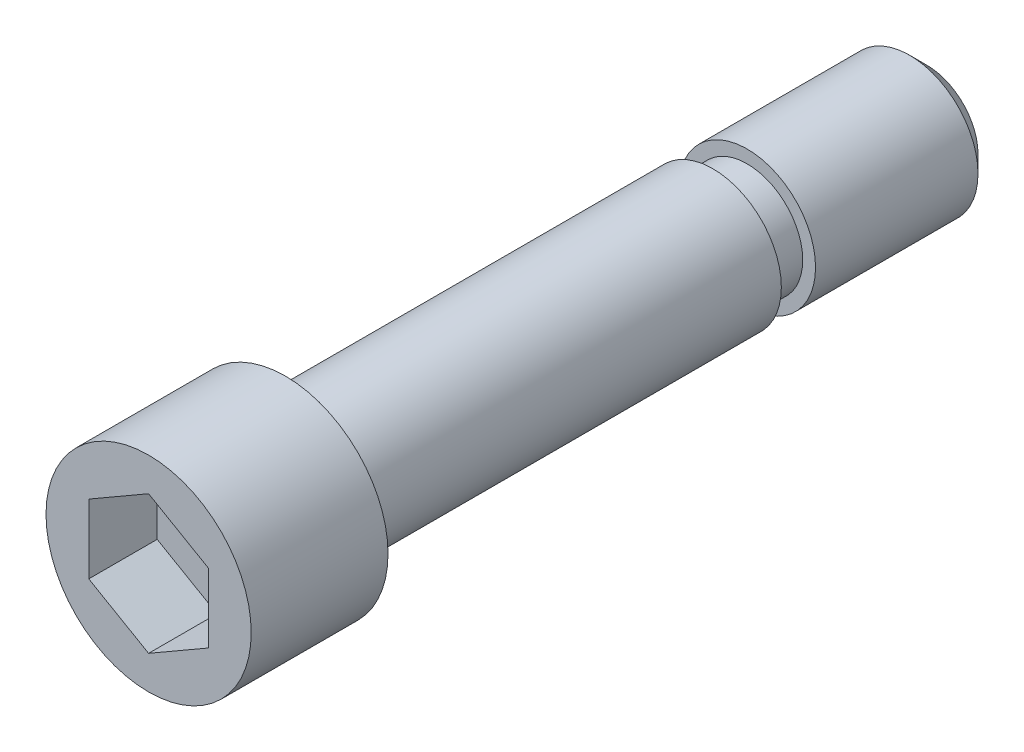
ISO-10303-21;
HEADER;
FILE_DESCRIPTION(('STEP AP214'),'2;1');
FILE_NAME('part.step','',(''),(''),'','','');
FILE_SCHEMA(('AUTOMOTIVE_DESIGN { 1 0 10303 214 1 1 1 1 }'));
ENDSEC;
DATA;
#1=APPLICATION_CONTEXT('core data for automotive mechanical design processes');
#2=APPLICATION_PROTOCOL_DEFINITION('international standard','automotive_design',2000,#1);
#3=PRODUCT_CONTEXT('',#1,'mechanical');
#4=PRODUCT('Part','Part','',(#3));
#5=PRODUCT_RELATED_PRODUCT_CATEGORY('part','',(#4));
#6=PRODUCT_DEFINITION_FORMATION('','',#4);
#7=PRODUCT_DEFINITION_CONTEXT('part definition',#1,'design');
#8=PRODUCT_DEFINITION('design','',#6,#7);
#9=PRODUCT_DEFINITION_SHAPE('','',#8);
#10=(LENGTH_UNIT() NAMED_UNIT(*) SI_UNIT(.MILLI.,.METRE.));
#11=(NAMED_UNIT(*) PLANE_ANGLE_UNIT() SI_UNIT($,.RADIAN.));
#12=(NAMED_UNIT(*) SI_UNIT($,.STERADIAN.) SOLID_ANGLE_UNIT());
#13=UNCERTAINTY_MEASURE_WITH_UNIT(LENGTH_MEASURE(1.E-05),#10,'distance_accuracy_value','');
#14=(GEOMETRIC_REPRESENTATION_CONTEXT(3) GLOBAL_UNCERTAINTY_ASSIGNED_CONTEXT((#13)) GLOBAL_UNIT_ASSIGNED_CONTEXT((#10,
#11,#12)) REPRESENTATION_CONTEXT('',''));
#15=CARTESIAN_POINT('',(0.,0.,0.));
#16=DIRECTION('',(0.,0.,1.));
#17=DIRECTION('',(1.,0.,0.));
#18=AXIS2_PLACEMENT_3D('',#15,#16,#17);
#19=CARTESIAN_POINT('',(-12.,0.,16.));
#20=DIRECTION('',(0.,0.,-1.));
#21=DIRECTION('',(-1.,0.,0.));
#22=AXIS2_PLACEMENT_3D('',#19,#20,#21);
#23=PLANE('',#22);
#24=DIRECTION('',(-0.866025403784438,-0.5,0.));
#25=VECTOR('',#24,1.);
#26=CARTESIAN_POINT('',(0.,8.08290376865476,16.));
#27=LINE('',#26,#25);
#28=CARTESIAN_POINT('',(0.,8.08290376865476,16.));
#29=VERTEX_POINT('',#28);
#30=CARTESIAN_POINT('',(-7.,4.04145188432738,16.));
#31=VERTEX_POINT('',#30);
#32=EDGE_CURVE('E82',#29,#31,#27,.T.);
#33=ORIENTED_EDGE('',*,*,#32,.F.);
#34=DIRECTION('',(-0.866025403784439,0.5,0.));
#35=VECTOR('',#34,1.);
#36=CARTESIAN_POINT('',(7.,4.04145188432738,16.));
#37=LINE('',#36,#35);
#38=CARTESIAN_POINT('',(7.,4.04145188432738,16.));
#39=VERTEX_POINT('',#38);
#40=EDGE_CURVE('E28',#39,#29,#37,.T.);
#41=ORIENTED_EDGE('',*,*,#40,.F.);
#42=DIRECTION('',(0.,1.,0.));
#43=VECTOR('',#42,1.);
#44=CARTESIAN_POINT('',(7.,-4.04145188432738,16.));
#45=LINE('',#44,#43);
#46=CARTESIAN_POINT('',(7.,-4.04145188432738,16.));
#47=VERTEX_POINT('',#46);
#48=EDGE_CURVE('E97',#47,#39,#45,.T.);
#49=ORIENTED_EDGE('',*,*,#48,.F.);
#50=DIRECTION('',(0.866025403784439,0.5,0.));
#51=VECTOR('',#50,1.);
#52=CARTESIAN_POINT('',(0.,-8.08290376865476,16.));
#53=LINE('',#52,#51);
#54=CARTESIAN_POINT('',(0.,-8.08290376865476,16.));
#55=VERTEX_POINT('',#54);
#56=EDGE_CURVE('E91',#55,#47,#53,.T.);
#57=ORIENTED_EDGE('',*,*,#56,.F.);
#58=DIRECTION('',(0.866025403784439,-0.5,0.));
#59=VECTOR('',#58,1.);
#60=CARTESIAN_POINT('',(-7.,-4.04145188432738,16.));
#61=LINE('',#60,#59);
#62=CARTESIAN_POINT('',(-7.,-4.04145188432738,16.));
#63=VERTEX_POINT('',#62);
#64=EDGE_CURVE('E89',#63,#55,#61,.T.);
#65=ORIENTED_EDGE('',*,*,#64,.F.);
#66=DIRECTION('',(0.,-1.,0.));
#67=VECTOR('',#66,1.);
#68=CARTESIAN_POINT('',(-7.,4.04145188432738,16.));
#69=LINE('',#68,#67);
#70=EDGE_CURVE('E71',#31,#63,#69,.T.);
#71=ORIENTED_EDGE('',*,*,#70,.F.);
#72=EDGE_LOOP('',(#33,#41,#49,#57,#65,#71));
#73=FACE_BOUND('',#72,.T.);
#74=CARTESIAN_POINT('',(0.,0.,16.));
#75=DIRECTION('',(0.,0.,1.));
#76=DIRECTION('',(1.,0.,0.));
#77=AXIS2_PLACEMENT_3D('',#74,#75,#76);
#78=CIRCLE('',#77,12.);
#79=CARTESIAN_POINT('',(12.,0.,16.));
#80=VERTEX_POINT('',#79);
#81=EDGE_CURVE('E9',#80,#80,#78,.T.);
#82=ORIENTED_EDGE('',*,*,#81,.T.);
#83=EDGE_LOOP('',(#82));
#84=FACE_BOUND('',#83,.T.);
#85=ADVANCED_FACE('F14',(#73,#84),#23,.F.);
#86=CARTESIAN_POINT('',(0.,0.,5.));
#87=DIRECTION('',(0.,0.,1.));
#88=DIRECTION('',(1.,0.,0.));
#89=AXIS2_PLACEMENT_3D('',#86,#87,#88);
#90=CYLINDRICAL_SURFACE('',#89,12.);
#91=ORIENTED_EDGE('',*,*,#81,.F.);
#92=EDGE_LOOP('',(#91));
#93=FACE_BOUND('',#92,.T.);
#94=CARTESIAN_POINT('',(0.,0.,0.));
#95=DIRECTION('',(0.,0.,1.));
#96=DIRECTION('',(1.,0.,0.));
#97=AXIS2_PLACEMENT_3D('',#94,#95,#96);
#98=CIRCLE('',#97,12.);
#99=CARTESIAN_POINT('',(12.,0.,0.));
#100=VERTEX_POINT('',#99);
#101=EDGE_CURVE('E21',#100,#100,#98,.T.);
#102=ORIENTED_EDGE('',*,*,#101,.T.);
#103=EDGE_LOOP('',(#102));
#104=FACE_BOUND('',#103,.T.);
#105=ADVANCED_FACE('F144',(#93,#104),#90,.T.);
#106=CARTESIAN_POINT('',(-8.,0.,0.));
#107=DIRECTION('',(0.,0.,1.));
#108=DIRECTION('',(1.,0.,0.));
#109=AXIS2_PLACEMENT_3D('',#106,#107,#108);
#110=PLANE('',#109);
#111=ORIENTED_EDGE('',*,*,#101,.F.);
#112=EDGE_LOOP('',(#111));
#113=FACE_BOUND('',#112,.T.);
#114=CARTESIAN_POINT('',(0.,0.,0.));
#115=DIRECTION('',(0.,0.,1.));
#116=DIRECTION('',(1.,0.,0.));
#117=AXIS2_PLACEMENT_3D('',#114,#115,#116);
#118=CIRCLE('',#117,8.);
#119=CARTESIAN_POINT('',(8.,0.,0.));
#120=VERTEX_POINT('',#119);
#121=EDGE_CURVE('E139',#120,#120,#118,.T.);
#122=ORIENTED_EDGE('',*,*,#121,.T.);
#123=EDGE_LOOP('',(#122));
#124=FACE_BOUND('',#123,.T.);
#125=ADVANCED_FACE('F146',(#113,#124),#110,.F.);
#126=CARTESIAN_POINT('',(0.,0.,5.));
#127=DIRECTION('',(0.,0.,1.));
#128=DIRECTION('',(1.,0.,0.));
#129=AXIS2_PLACEMENT_3D('',#126,#127,#128);
#130=CYLINDRICAL_SURFACE('',#129,8.);
#131=ORIENTED_EDGE('',*,*,#121,.F.);
#132=EDGE_LOOP('',(#131));
#133=FACE_BOUND('',#132,.T.);
#134=CARTESIAN_POINT('',(0.,0.,-50.));
#135=DIRECTION('',(0.,0.,1.));
#136=DIRECTION('',(1.,0.,0.));
#137=AXIS2_PLACEMENT_3D('',#134,#135,#136);
#138=CIRCLE('',#137,8.);
#139=CARTESIAN_POINT('',(8.,0.,-50.));
#140=VERTEX_POINT('',#139);
#141=EDGE_CURVE('E136',#140,#140,#138,.T.);
#142=ORIENTED_EDGE('',*,*,#141,.T.);
#143=EDGE_LOOP('',(#142));
#144=FACE_BOUND('',#143,.T.);
#145=ADVANCED_FACE('F149',(#133,#144),#130,.T.);
#146=CARTESIAN_POINT('',(-6.5,0.,-50.));
#147=DIRECTION('',(0.,0.,1.));
#148=DIRECTION('',(1.,0.,0.));
#149=AXIS2_PLACEMENT_3D('',#146,#147,#148);
#150=PLANE('',#149);
#151=ORIENTED_EDGE('',*,*,#141,.F.);
#152=EDGE_LOOP('',(#151));
#153=FACE_BOUND('',#152,.T.);
#154=CARTESIAN_POINT('',(0.,0.,-50.));
#155=DIRECTION('',(0.,0.,1.));
#156=DIRECTION('',(1.,0.,0.));
#157=AXIS2_PLACEMENT_3D('',#154,#155,#156);
#158=CIRCLE('',#157,6.5);
#159=CARTESIAN_POINT('',(6.5,0.,-50.));
#160=VERTEX_POINT('',#159);
#161=EDGE_CURVE('E133',#160,#160,#158,.T.);
#162=ORIENTED_EDGE('',*,*,#161,.T.);
#163=EDGE_LOOP('',(#162));
#164=FACE_BOUND('',#163,.T.);
#165=ADVANCED_FACE('F155',(#153,#164),#150,.F.);
#166=CARTESIAN_POINT('',(0.,0.,5.));
#167=DIRECTION('',(0.,0.,1.));
#168=DIRECTION('',(1.,0.,0.));
#169=AXIS2_PLACEMENT_3D('',#166,#167,#168);
#170=CYLINDRICAL_SURFACE('',#169,6.5);
#171=ORIENTED_EDGE('',*,*,#161,.F.);
#172=EDGE_LOOP('',(#171));
#173=FACE_BOUND('',#172,.T.);
#174=CARTESIAN_POINT('',(0.,0.,-54.));
#175=DIRECTION('',(0.,0.,1.));
#176=DIRECTION('',(1.,0.,0.));
#177=AXIS2_PLACEMENT_3D('',#174,#175,#176);
#178=CIRCLE('',#177,6.5);
#179=CARTESIAN_POINT('',(6.5,0.,-54.));
#180=VERTEX_POINT('',#179);
#181=EDGE_CURVE('E130',#180,#180,#178,.T.);
#182=ORIENTED_EDGE('',*,*,#181,.T.);
#183=EDGE_LOOP('',(#182));
#184=FACE_BOUND('',#183,.T.);
#185=ADVANCED_FACE('F161',(#173,#184),#170,.T.);
#186=CARTESIAN_POINT('',(-8.,0.,-54.));
#187=DIRECTION('',(0.,0.,-1.));
#188=DIRECTION('',(-1.,0.,0.));
#189=AXIS2_PLACEMENT_3D('',#186,#187,#188);
#190=PLANE('',#189);
#191=ORIENTED_EDGE('',*,*,#181,.F.);
#192=EDGE_LOOP('',(#191));
#193=FACE_BOUND('',#192,.T.);
#194=CARTESIAN_POINT('',(0.,0.,-54.));
#195=DIRECTION('',(0.,0.,1.));
#196=DIRECTION('',(1.,0.,0.));
#197=AXIS2_PLACEMENT_3D('',#194,#195,#196);
#198=CIRCLE('',#197,8.);
#199=CARTESIAN_POINT('',(8.,0.,-54.));
#200=VERTEX_POINT('',#199);
#201=EDGE_CURVE('E127',#200,#200,#198,.T.);
#202=ORIENTED_EDGE('',*,*,#201,.T.);
#203=EDGE_LOOP('',(#202));
#204=FACE_BOUND('',#203,.T.);
#205=ADVANCED_FACE('F167',(#193,#204),#190,.F.);
#206=CARTESIAN_POINT('',(0.,0.,5.));
#207=DIRECTION('',(0.,0.,1.));
#208=DIRECTION('',(1.,0.,0.));
#209=AXIS2_PLACEMENT_3D('',#206,#207,#208);
#210=CYLINDRICAL_SURFACE('',#209,8.);
#211=ORIENTED_EDGE('',*,*,#201,.F.);
#212=EDGE_LOOP('',(#211));
#213=FACE_BOUND('',#212,.T.);
#214=CARTESIAN_POINT('',(0.,0.,-73.));
#215=DIRECTION('',(0.,0.,1.));
#216=DIRECTION('',(1.,0.,0.));
#217=AXIS2_PLACEMENT_3D('',#214,#215,#216);
#218=CIRCLE('',#217,8.);
#219=CARTESIAN_POINT('',(8.,0.,-73.));
#220=VERTEX_POINT('',#219);
#221=EDGE_CURVE('E124',#220,#220,#218,.T.);
#222=ORIENTED_EDGE('',*,*,#221,.T.);
#223=EDGE_LOOP('',(#222));
#224=FACE_BOUND('',#223,.T.);
#225=ADVANCED_FACE('F173',(#213,#224),#210,.T.);
#226=CARTESIAN_POINT('',(0.,0.,-75.));
#227=DIRECTION('',(0.,0.,1.));
#228=DIRECTION('',(1.,0.,0.));
#229=AXIS2_PLACEMENT_3D('',#226,#227,#228);
#230=CONICAL_SURFACE('',#229,6.,0.785398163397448);
#231=ORIENTED_EDGE('',*,*,#221,.F.);
#232=EDGE_LOOP('',(#231));
#233=FACE_BOUND('',#232,.T.);
#234=CARTESIAN_POINT('',(0.,0.,-75.));
#235=DIRECTION('',(0.,0.,1.));
#236=DIRECTION('',(1.,0.,0.));
#237=AXIS2_PLACEMENT_3D('',#234,#235,#236);
#238=CIRCLE('',#237,6.);
#239=CARTESIAN_POINT('',(6.,0.,-75.));
#240=VERTEX_POINT('',#239);
#241=EDGE_CURVE('E115',#240,#240,#238,.T.);
#242=ORIENTED_EDGE('',*,*,#241,.T.);
#243=EDGE_LOOP('',(#242));
#244=FACE_BOUND('',#243,.T.);
#245=ADVANCED_FACE('F179',(#233,#244),#230,.T.);
#246=CARTESIAN_POINT('',(0.,0.,-75.));
#247=DIRECTION('',(0.,0.,1.));
#248=DIRECTION('',(1.,0.,0.));
#249=AXIS2_PLACEMENT_3D('',#246,#247,#248);
#250=PLANE('',#249);
#251=ORIENTED_EDGE('',*,*,#241,.F.);
#252=EDGE_LOOP('',(#251));
#253=FACE_BOUND('',#252,.T.);
#254=ADVANCED_FACE('F185',(#253),#250,.F.);
#255=CARTESIAN_POINT('',(7.,4.04145188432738,8.));
#256=DIRECTION('',(0.5,0.866025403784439,0.));
#257=DIRECTION('',(-0.866025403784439,0.5,0.));
#258=AXIS2_PLACEMENT_3D('',#255,#256,#257);
#259=PLANE('',#258);
#260=ORIENTED_EDGE('',*,*,#40,.T.);
#261=DIRECTION('',(0.,0.,1.));
#262=VECTOR('',#261,1.);
#263=CARTESIAN_POINT('',(0.,8.08290376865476,8.));
#264=LINE('',#263,#262);
#265=CARTESIAN_POINT('',(0.,8.08290376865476,8.));
#266=VERTEX_POINT('',#265);
#267=EDGE_CURVE('E79',#266,#29,#264,.T.);
#268=ORIENTED_EDGE('',*,*,#267,.F.);
#269=DIRECTION('',(-0.866025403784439,0.5,0.));
#270=VECTOR('',#269,1.);
#271=CARTESIAN_POINT('',(7.,4.04145188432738,8.));
#272=LINE('',#271,#270);
#273=CARTESIAN_POINT('',(7.,4.04145188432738,8.));
#274=VERTEX_POINT('',#273);
#275=EDGE_CURVE('E99',#274,#266,#272,.T.);
#276=ORIENTED_EDGE('',*,*,#275,.F.);
#277=DIRECTION('',(0.,0.,1.));
#278=VECTOR('',#277,1.);
#279=CARTESIAN_POINT('',(7.,4.04145188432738,8.));
#280=LINE('',#279,#278);
#281=EDGE_CURVE('E35',#274,#39,#280,.T.);
#282=ORIENTED_EDGE('',*,*,#281,.T.);
#283=EDGE_LOOP('',(#260,#268,#276,#282));
#284=FACE_BOUND('',#283,.T.);
#285=ADVANCED_FACE('F190',(#284),#259,.F.);
#286=CARTESIAN_POINT('',(7.,-4.04145188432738,8.));
#287=DIRECTION('',(1.,0.,0.));
#288=DIRECTION('',(0.,1.,0.));
#289=AXIS2_PLACEMENT_3D('',#286,#287,#288);
#290=PLANE('',#289);
#291=ORIENTED_EDGE('',*,*,#48,.T.);
#292=ORIENTED_EDGE('',*,*,#281,.F.);
#293=DIRECTION('',(0.,1.,0.));
#294=VECTOR('',#293,1.);
#295=CARTESIAN_POINT('',(7.,-4.04145188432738,8.));
#296=LINE('',#295,#294);
#297=CARTESIAN_POINT('',(7.,-4.04145188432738,8.));
#298=VERTEX_POINT('',#297);
#299=EDGE_CURVE('E111',#298,#274,#296,.T.);
#300=ORIENTED_EDGE('',*,*,#299,.F.);
#301=DIRECTION('',(0.,0.,1.));
#302=VECTOR('',#301,1.);
#303=CARTESIAN_POINT('',(7.,-4.04145188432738,8.));
#304=LINE('',#303,#302);
#305=EDGE_CURVE('E116',#298,#47,#304,.T.);
#306=ORIENTED_EDGE('',*,*,#305,.T.);
#307=EDGE_LOOP('',(#291,#292,#300,#306));
#308=FACE_BOUND('',#307,.T.);
#309=ADVANCED_FACE('F196',(#308),#290,.F.);
#310=CARTESIAN_POINT('',(0.,-8.08290376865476,8.));
#311=DIRECTION('',(0.5,-0.866025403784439,0.));
#312=DIRECTION('',(0.866025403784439,0.5,0.));
#313=AXIS2_PLACEMENT_3D('',#310,#311,#312);
#314=PLANE('',#313);
#315=ORIENTED_EDGE('',*,*,#56,.T.);
#316=ORIENTED_EDGE('',*,*,#305,.F.);
#317=DIRECTION('',(0.866025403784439,0.5,0.));
#318=VECTOR('',#317,1.);
#319=CARTESIAN_POINT('',(0.,-8.08290376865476,8.));
#320=LINE('',#319,#318);
#321=CARTESIAN_POINT('',(0.,-8.08290376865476,8.));
#322=VERTEX_POINT('',#321);
#323=EDGE_CURVE('E108',#322,#298,#320,.T.);
#324=ORIENTED_EDGE('',*,*,#323,.F.);
#325=DIRECTION('',(0.,0.,1.));
#326=VECTOR('',#325,1.);
#327=CARTESIAN_POINT('',(0.,-8.08290376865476,8.));
#328=LINE('',#327,#326);
#329=EDGE_CURVE('E118',#322,#55,#328,.T.);
#330=ORIENTED_EDGE('',*,*,#329,.T.);
#331=EDGE_LOOP('',(#315,#316,#324,#330));
#332=FACE_BOUND('',#331,.T.);
#333=ADVANCED_FACE('F267',(#332),#314,.F.);
#334=CARTESIAN_POINT('',(-7.,-4.04145188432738,8.));
#335=DIRECTION('',(-0.5,-0.866025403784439,0.));
#336=DIRECTION('',(0.866025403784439,-0.5,0.));
#337=AXIS2_PLACEMENT_3D('',#334,#335,#336);
#338=PLANE('',#337);
#339=ORIENTED_EDGE('',*,*,#64,.T.);
#340=ORIENTED_EDGE('',*,*,#329,.F.);
#341=DIRECTION('',(0.866025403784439,-0.5,0.));
#342=VECTOR('',#341,1.);
#343=CARTESIAN_POINT('',(-7.,-4.04145188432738,8.));
#344=LINE('',#343,#342);
#345=CARTESIAN_POINT('',(-7.,-4.04145188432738,8.));
#346=VERTEX_POINT('',#345);
#347=EDGE_CURVE('E105',#346,#322,#344,.T.);
#348=ORIENTED_EDGE('',*,*,#347,.F.);
#349=DIRECTION('',(0.,0.,1.));
#350=VECTOR('',#349,1.);
#351=CARTESIAN_POINT('',(-7.,-4.04145188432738,8.));
#352=LINE('',#351,#350);
#353=EDGE_CURVE('E78',#346,#63,#352,.T.);
#354=ORIENTED_EDGE('',*,*,#353,.T.);
#355=EDGE_LOOP('',(#339,#340,#348,#354));
#356=FACE_BOUND('',#355,.T.);
#357=ADVANCED_FACE('F276',(#356),#338,.F.);
#358=CARTESIAN_POINT('',(-7.,4.04145188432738,8.));
#359=DIRECTION('',(-1.,0.,0.));
#360=DIRECTION('',(0.,-1.,0.));
#361=AXIS2_PLACEMENT_3D('',#358,#359,#360);
#362=PLANE('',#361);
#363=ORIENTED_EDGE('',*,*,#70,.T.);
#364=ORIENTED_EDGE('',*,*,#353,.F.);
#365=DIRECTION('',(0.,-1.,0.));
#366=VECTOR('',#365,1.);
#367=CARTESIAN_POINT('',(-7.,4.04145188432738,8.));
#368=LINE('',#367,#366);
#369=CARTESIAN_POINT('',(-7.,4.04145188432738,8.));
#370=VERTEX_POINT('',#369);
#371=EDGE_CURVE('E74',#370,#346,#368,.T.);
#372=ORIENTED_EDGE('',*,*,#371,.F.);
#373=DIRECTION('',(0.,0.,1.));
#374=VECTOR('',#373,1.);
#375=CARTESIAN_POINT('',(-7.,4.04145188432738,8.));
#376=LINE('',#375,#374);
#377=EDGE_CURVE('E67',#370,#31,#376,.T.);
#378=ORIENTED_EDGE('',*,*,#377,.T.);
#379=EDGE_LOOP('',(#363,#364,#372,#378));
#380=FACE_BOUND('',#379,.T.);
#381=ADVANCED_FACE('F69',(#380),#362,.F.);
#382=CARTESIAN_POINT('',(0.,8.08290376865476,8.));
#383=DIRECTION('',(-0.5,0.866025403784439,0.));
#384=DIRECTION('',(-0.866025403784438,-0.5,0.));
#385=AXIS2_PLACEMENT_3D('',#382,#383,#384);
#386=PLANE('',#385);
#387=ORIENTED_EDGE('',*,*,#32,.T.);
#388=ORIENTED_EDGE('',*,*,#377,.F.);
#389=DIRECTION('',(-0.866025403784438,-0.5,0.));
#390=VECTOR('',#389,1.);
#391=CARTESIAN_POINT('',(0.,8.08290376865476,8.));
#392=LINE('',#391,#390);
#393=EDGE_CURVE('E102',#266,#370,#392,.T.);
#394=ORIENTED_EDGE('',*,*,#393,.F.);
#395=ORIENTED_EDGE('',*,*,#267,.T.);
#396=EDGE_LOOP('',(#387,#388,#394,#395));
#397=FACE_BOUND('',#396,.T.);
#398=ADVANCED_FACE('F83',(#397),#386,.F.);
#399=CARTESIAN_POINT('',(-7.,12.1243556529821,8.));
#400=DIRECTION('',(0.,0.,1.));
#401=DIRECTION('',(1.,0.,0.));
#402=AXIS2_PLACEMENT_3D('',#399,#400,#401);
#403=PLANE('',#402);
#404=ORIENTED_EDGE('',*,*,#275,.T.);
#405=ORIENTED_EDGE('',*,*,#393,.T.);
#406=ORIENTED_EDGE('',*,*,#371,.T.);
#407=ORIENTED_EDGE('',*,*,#347,.T.);
#408=ORIENTED_EDGE('',*,*,#323,.T.);
#409=ORIENTED_EDGE('',*,*,#299,.T.);
#410=EDGE_LOOP('',(#404,#405,#406,#407,#408,#409));
#411=FACE_BOUND('',#410,.T.);
#412=ADVANCED_FACE('F303',(#411),#403,.T.);
#413=CLOSED_SHELL('',(#85,#105,#125,#145,#165,#185,#205,#225,#245,#254,#285,#309,#333,#357,#381,
#398,#412));
#414=MANIFOLD_SOLID_BREP('B1',#413);
#415=ADVANCED_BREP_SHAPE_REPRESENTATION('',(#18,#414),#14);
#416=SHAPE_DEFINITION_REPRESENTATION(#9,#415);
ENDSEC;
END-ISO-10303-21;
